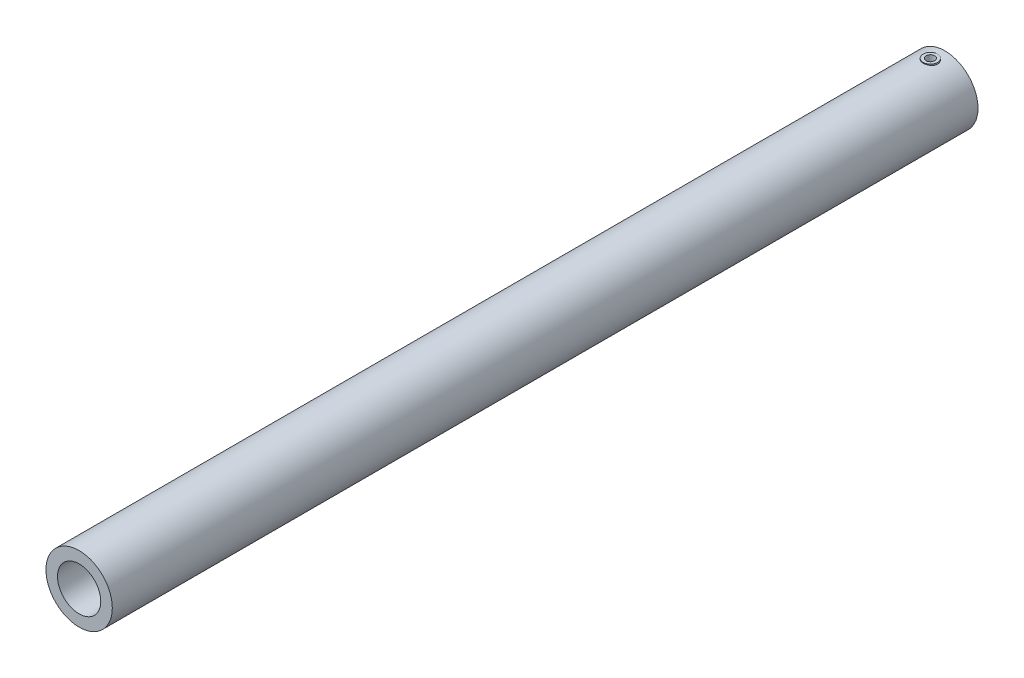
ISO-10303-21;
HEADER;
FILE_DESCRIPTION(('STEP AP214'),'2;1');
FILE_NAME('part.step','',(''),(''),'','','');
FILE_SCHEMA(('AUTOMOTIVE_DESIGN { 1 0 10303 214 1 1 1 1 }'));
ENDSEC;
DATA;
#1=APPLICATION_CONTEXT('core data for automotive mechanical design processes');
#2=APPLICATION_PROTOCOL_DEFINITION('international standard','automotive_design',2000,#1);
#3=PRODUCT_CONTEXT('',#1,'mechanical');
#4=PRODUCT('Part','Part','',(#3));
#5=PRODUCT_RELATED_PRODUCT_CATEGORY('part','',(#4));
#6=PRODUCT_DEFINITION_FORMATION('','',#4);
#7=PRODUCT_DEFINITION_CONTEXT('part definition',#1,'design');
#8=PRODUCT_DEFINITION('design','',#6,#7);
#9=PRODUCT_DEFINITION_SHAPE('','',#8);
#10=(LENGTH_UNIT() NAMED_UNIT(*) SI_UNIT(.MILLI.,.METRE.));
#11=(NAMED_UNIT(*) PLANE_ANGLE_UNIT() SI_UNIT($,.RADIAN.));
#12=(NAMED_UNIT(*) SI_UNIT($,.STERADIAN.) SOLID_ANGLE_UNIT());
#13=UNCERTAINTY_MEASURE_WITH_UNIT(LENGTH_MEASURE(1.E-05),#10,'distance_accuracy_value','');
#14=(GEOMETRIC_REPRESENTATION_CONTEXT(3) GLOBAL_UNCERTAINTY_ASSIGNED_CONTEXT((#13)) GLOBAL_UNIT_ASSIGNED_CONTEXT((#10,
#11,#12)) REPRESENTATION_CONTEXT('',''));
#15=CARTESIAN_POINT('',(0.,0.,0.));
#16=DIRECTION('',(0.,0.,1.));
#17=DIRECTION('',(1.,0.,0.));
#18=AXIS2_PLACEMENT_3D('',#15,#16,#17);
#19=CARTESIAN_POINT('',(0.,0.,600.));
#20=DIRECTION('',(0.,0.,-1.));
#21=DIRECTION('',(-1.,0.,0.));
#22=AXIS2_PLACEMENT_3D('',#19,#20,#21);
#23=CYLINDRICAL_SURFACE('',#22,23.);
#24=CARTESIAN_POINT('',(0.,0.,0.));
#25=DIRECTION('',(0.,0.,1.));
#26=DIRECTION('',(1.,0.,0.));
#27=AXIS2_PLACEMENT_3D('',#24,#25,#26);
#28=CIRCLE('',#27,23.);
#29=CARTESIAN_POINT('',(23.,0.,0.));
#30=VERTEX_POINT('',#29);
#31=EDGE_CURVE('E43',#30,#30,#28,.T.);
#32=ORIENTED_EDGE('',*,*,#31,.T.);
#33=EDGE_LOOP('',(#32));
#34=FACE_BOUND('',#33,.T.);
#35=CARTESIAN_POINT('',(0.,0.,600.));
#36=DIRECTION('',(0.,0.,1.));
#37=DIRECTION('',(1.,0.,0.));
#38=AXIS2_PLACEMENT_3D('',#35,#36,#37);
#39=CIRCLE('',#38,23.);
#40=CARTESIAN_POINT('',(23.,0.,600.));
#41=VERTEX_POINT('',#40);
#42=EDGE_CURVE('E39',#41,#41,#39,.T.);
#43=ORIENTED_EDGE('',*,*,#42,.F.);
#44=EDGE_LOOP('',(#43));
#45=FACE_BOUND('',#44,.T.);
#46=CARTESIAN_POINT('',(0.,23.,15.));
#47=CARTESIAN_POINT('',(0.277355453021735,22.9999948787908,14.9999904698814));
#48=CARTESIAN_POINT('',(0.554826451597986,22.9949320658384,14.9768442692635));
#49=CARTESIAN_POINT('',(1.10188982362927,22.9752244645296,14.8849654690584));
#50=CARTESIAN_POINT('',(1.37147637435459,22.9605727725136,14.8162000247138));
#51=CARTESIAN_POINT('',(1.89478531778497,22.9233191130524,14.6353360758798));
#52=CARTESIAN_POINT('',(2.14852386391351,22.9007254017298,14.523282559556));
#53=CARTESIAN_POINT('',(2.63358953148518,22.8500275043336,14.2591653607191));
#54=CARTESIAN_POINT('',(2.86491728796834,22.8219234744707,14.1071028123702));
#55=CARTESIAN_POINT('',(3.30227374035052,22.7627863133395,13.7647311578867));
#56=CARTESIAN_POINT('',(3.50789604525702,22.7317172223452,13.5739090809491));
#57=CARTESIAN_POINT('',(3.8844813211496,22.6704056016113,13.1605364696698));
#58=CARTESIAN_POINT('',(4.05544123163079,22.6401631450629,12.9379831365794));
#59=CARTESIAN_POINT('',(4.35963714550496,22.5835746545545,12.4644667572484));
#60=CARTESIAN_POINT('',(4.49244139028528,22.557274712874,12.2132203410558));
#61=CARTESIAN_POINT('',(4.7137868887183,22.5120647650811,11.6913104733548));
#62=CARTESIAN_POINT('',(4.8023333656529,22.4931538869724,11.4206493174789));
#63=CARTESIAN_POINT('',(4.93130849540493,22.4652292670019,10.8719987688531));
#64=CARTESIAN_POINT('',(4.97245619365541,22.4560677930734,10.5941860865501));
#65=CARTESIAN_POINT('',(5.00770133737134,22.4482355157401,10.0354611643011));
#66=CARTESIAN_POINT('',(5.00180449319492,22.4495634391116,9.75454930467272));
#67=CARTESIAN_POINT('',(4.94370678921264,22.462426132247,9.20293933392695));
#68=CARTESIAN_POINT('',(4.89234041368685,22.473776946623,8.93214839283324));
#69=CARTESIAN_POINT('',(4.74608346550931,22.5051157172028,8.40312176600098));
#70=CARTESIAN_POINT('',(4.65119047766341,22.5251041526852,8.14488677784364));
#71=CARTESIAN_POINT('',(4.41980547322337,22.5716477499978,7.64595211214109));
#72=CARTESIAN_POINT('',(4.28299185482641,22.5982533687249,7.40540648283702));
#73=CARTESIAN_POINT('',(3.97187541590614,22.6550024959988,6.95037821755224));
#74=CARTESIAN_POINT('',(3.79756754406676,22.685146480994,6.73589909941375));
#75=CARTESIAN_POINT('',(3.41198948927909,22.7463657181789,6.33428694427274));
#76=CARTESIAN_POINT('',(3.20000952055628,22.7774471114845,6.14783562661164));
#77=CARTESIAN_POINT('',(2.74743924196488,22.8364526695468,5.81301931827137));
#78=CARTESIAN_POINT('',(2.50684842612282,22.8643767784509,5.66465500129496));
#79=CARTESIAN_POINT('',(2.00305938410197,22.9140103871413,5.41005890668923));
#80=CARTESIAN_POINT('',(1.73981507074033,22.9357068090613,5.30391561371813));
#81=CARTESIAN_POINT('',(1.19865085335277,22.9703430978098,5.13755845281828));
#82=CARTESIAN_POINT('',(0.920733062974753,22.9832842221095,5.07733798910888));
#83=CARTESIAN_POINT('',(0.363959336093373,22.998773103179,5.0055255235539));
#84=CARTESIAN_POINT('',(0.0852289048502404,23.0015198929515,4.99300216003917));
#85=CARTESIAN_POINT('',(-0.470341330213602,22.9968679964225,5.01441617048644));
#86=CARTESIAN_POINT('',(-0.747181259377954,22.9894699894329,5.04835043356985));
#87=CARTESIAN_POINT('',(-1.28803214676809,22.965485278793,5.16094402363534));
#88=CARTESIAN_POINT('',(-1.55214947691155,22.9489988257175,5.23911563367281));
#89=CARTESIAN_POINT('',(-2.06352339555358,22.908682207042,5.43742418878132));
#90=CARTESIAN_POINT('',(-2.31077855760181,22.8848514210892,5.55756467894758));
#91=CARTESIAN_POINT('',(-2.78526633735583,22.8319982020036,5.83834667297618));
#92=CARTESIAN_POINT('',(-3.01216677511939,22.8029071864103,5.99953632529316));
#93=CARTESIAN_POINT('',(-3.43603237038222,22.7429019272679,6.35711834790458));
#94=CARTESIAN_POINT('',(-3.63299368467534,22.7119874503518,6.55351523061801));
#95=CARTESIAN_POINT('',(-3.99506577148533,22.6511332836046,6.98020810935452));
#96=CARTESIAN_POINT('',(-4.15953201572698,22.6212215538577,7.21105574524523));
#97=CARTESIAN_POINT('',(-4.44736358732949,22.5664022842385,7.69764303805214));
#98=CARTESIAN_POINT('',(-4.57073068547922,22.5414945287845,7.95338162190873));
#99=CARTESIAN_POINT('',(-4.7720341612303,22.4997392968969,8.48112433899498));
#100=CARTESIAN_POINT('',(-4.8502247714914,22.4828468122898,8.75302776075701));
#101=CARTESIAN_POINT('',(-4.95970263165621,22.4589524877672,9.30652786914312));
#102=CARTESIAN_POINT('',(-4.99099727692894,22.4519490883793,9.58812302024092));
#103=CARTESIAN_POINT('',(-5.00548311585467,22.448723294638,10.1465166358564));
#104=CARTESIAN_POINT('',(-4.98969596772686,22.4522719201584,10.4232877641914));
#105=CARTESIAN_POINT('',(-4.91274819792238,22.4692329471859,10.9701251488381));
#106=CARTESIAN_POINT('',(-4.85158809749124,22.482645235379,11.2401914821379));
#107=CARTESIAN_POINT('',(-4.68612139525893,22.5177114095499,11.7651534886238));
#108=CARTESIAN_POINT('',(-4.5819617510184,22.5393372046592,12.0200974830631));
#109=CARTESIAN_POINT('',(-4.33357956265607,22.5884050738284,12.5090440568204));
#110=CARTESIAN_POINT('',(-4.1893529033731,22.6158477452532,12.7430444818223));
#111=CARTESIAN_POINT('',(-3.86153463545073,22.6741425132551,13.1885016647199));
#112=CARTESIAN_POINT('',(-3.67721419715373,22.7050517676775,13.3994146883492));
#113=CARTESIAN_POINT('',(-3.27591964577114,22.7664110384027,13.7876521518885));
#114=CARTESIAN_POINT('',(-3.05893799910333,22.796860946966,13.9649688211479));
#115=CARTESIAN_POINT('',(-2.59513904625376,22.8543320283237,14.283147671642));
#116=CARTESIAN_POINT('',(-2.34797586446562,22.8813044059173,14.4235149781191));
#117=CARTESIAN_POINT('',(-1.83303166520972,22.9282925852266,14.6604916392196));
#118=CARTESIAN_POINT('',(-1.56526825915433,22.948314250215,14.7571378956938));
#119=CARTESIAN_POINT('',(-1.08101000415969,22.9755491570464,14.8865936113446));
#120=CARTESIAN_POINT('',(-0.867145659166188,22.9846616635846,14.9290402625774));
#121=CARTESIAN_POINT('',(-0.435544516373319,22.9968889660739,14.9857465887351));
#122=CARTESIAN_POINT('',(-0.217807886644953,23.0000040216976,15.0000074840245));
#123=CARTESIAN_POINT('',(0.,23.,15.));
#124=B_SPLINE_CURVE_WITH_KNOTS('',3,(#46,#47,#48,#49,#50,#51,#52,#53,#54,#55,#56,#57,#58,#59,
#60,#61,#62,#63,#64,#65,#66,#67,#68,#69,#70,#71,#72,#73,#74,#75,#76,#77,#78,#79,#80,#81,#82,#83,
#84,#85,#86,#87,#88,#89,#90,#91,#92,#93,#94,#95,#96,#97,#98,#99,#100,#101,#102,#103,#104,#105,
#106,#107,#108,#109,#110,#111,#112,#113,#114,#115,#116,#117,#118,#119,#120,#121,#122,#123),
.UNSPECIFIED.,.T.,.F.,(4,2,2,2,2,2,2,2,2,2,2,2,2,2,2,2,2,2,2,2,2,2,2,2,2,2,2,2,2,2,2,2,2,2,2,2,
2,2,4),(0.,0.831269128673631,1.66313740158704,2.49414345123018,3.32512594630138,4.1679214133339,
5.01079126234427,5.8628536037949,6.71481536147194,7.55367510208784,8.39243302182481,
9.21610950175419,10.0398316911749,10.8700385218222,11.7003572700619,12.5484059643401,
13.3964696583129,14.2463014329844,15.0960111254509,15.9290411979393,16.7620154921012,
17.5859803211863,18.4100147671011,19.2456896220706,20.0814716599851,20.9324565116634,
21.7834046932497,22.6295162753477,23.4754944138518,24.3032496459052,25.1309953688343,
25.9559352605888,26.7809599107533,27.6224659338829,28.4641663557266,29.3166242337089,
30.1683612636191,30.8211871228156,31.4739847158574),.UNSPECIFIED.);
#125=CARTESIAN_POINT('',(0.,23.,15.));
#126=VERTEX_POINT('',#125);
#127=EDGE_CURVE('E55',#126,#126,#124,.T.);
#128=ORIENTED_EDGE('',*,*,#127,.F.);
#129=EDGE_LOOP('',(#128));
#130=FACE_BOUND('',#129,.T.);
#131=CARTESIAN_POINT('',(0.,-23.,5.));
#132=CARTESIAN_POINT('',(0.277355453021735,-22.9999948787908,5.00000953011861));
#133=CARTESIAN_POINT('',(0.554826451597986,-22.9949320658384,5.02315573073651));
#134=CARTESIAN_POINT('',(1.10188982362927,-22.9752244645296,5.11503453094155));
#135=CARTESIAN_POINT('',(1.37147637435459,-22.9605727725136,5.18379997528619));
#136=CARTESIAN_POINT('',(1.89478531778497,-22.9233191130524,5.36466392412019));
#137=CARTESIAN_POINT('',(2.14852386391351,-22.9007254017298,5.47671744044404));
#138=CARTESIAN_POINT('',(2.63358953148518,-22.8500275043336,5.74083463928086));
#139=CARTESIAN_POINT('',(2.86491728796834,-22.8219234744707,5.89289718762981));
#140=CARTESIAN_POINT('',(3.30227374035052,-22.7627863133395,6.23526884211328));
#141=CARTESIAN_POINT('',(3.50789604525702,-22.7317172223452,6.42609091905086));
#142=CARTESIAN_POINT('',(3.8844813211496,-22.6704056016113,6.83946353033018));
#143=CARTESIAN_POINT('',(4.05544123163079,-22.6401631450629,7.06201686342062));
#144=CARTESIAN_POINT('',(4.35963714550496,-22.5835746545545,7.53553324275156));
#145=CARTESIAN_POINT('',(4.49244139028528,-22.557274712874,7.78677965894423));
#146=CARTESIAN_POINT('',(4.7137868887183,-22.5120647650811,8.30868952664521));
#147=CARTESIAN_POINT('',(4.80233336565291,-22.4931538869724,8.57935068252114));
#148=CARTESIAN_POINT('',(4.93130849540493,-22.4652292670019,9.12800123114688));
#149=CARTESIAN_POINT('',(4.97245619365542,-22.4560677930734,9.4058139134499));
#150=CARTESIAN_POINT('',(5.00770133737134,-22.4482355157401,9.96453883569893));
#151=CARTESIAN_POINT('',(5.00180449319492,-22.4495634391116,10.2454506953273));
#152=CARTESIAN_POINT('',(4.94370678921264,-22.462426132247,10.797060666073));
#153=CARTESIAN_POINT('',(4.89234041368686,-22.473776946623,11.0678516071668));
#154=CARTESIAN_POINT('',(4.74608346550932,-22.5051157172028,11.596878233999));
#155=CARTESIAN_POINT('',(4.65119047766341,-22.5251041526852,11.8551132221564));
#156=CARTESIAN_POINT('',(4.41980547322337,-22.5716477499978,12.3540478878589));
#157=CARTESIAN_POINT('',(4.28299185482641,-22.5982533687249,12.594593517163));
#158=CARTESIAN_POINT('',(3.97187541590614,-22.6550024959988,13.0496217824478));
#159=CARTESIAN_POINT('',(3.79756754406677,-22.685146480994,13.2641009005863));
#160=CARTESIAN_POINT('',(3.41198948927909,-22.7463657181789,13.6657130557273));
#161=CARTESIAN_POINT('',(3.20000952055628,-22.7774471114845,13.8521643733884));
#162=CARTESIAN_POINT('',(2.74743924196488,-22.8364526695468,14.1869806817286));
#163=CARTESIAN_POINT('',(2.50684842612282,-22.8643767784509,14.335344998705));
#164=CARTESIAN_POINT('',(2.00305938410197,-22.9140103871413,14.5899410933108));
#165=CARTESIAN_POINT('',(1.73981507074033,-22.9357068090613,14.6960843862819));
#166=CARTESIAN_POINT('',(1.19865085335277,-22.9703430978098,14.8624415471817));
#167=CARTESIAN_POINT('',(0.920733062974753,-22.9832842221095,14.9226620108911));
#168=CARTESIAN_POINT('',(0.363959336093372,-22.998773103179,14.9944744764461));
#169=CARTESIAN_POINT('',(0.0852289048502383,-23.0015198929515,15.0069978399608));
#170=CARTESIAN_POINT('',(-0.470341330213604,-22.9968679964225,14.9855838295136));
#171=CARTESIAN_POINT('',(-0.747181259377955,-22.9894699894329,14.9516495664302));
#172=CARTESIAN_POINT('',(-1.28803214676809,-22.965485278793,14.8390559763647));
#173=CARTESIAN_POINT('',(-1.55214947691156,-22.9489988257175,14.7608843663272));
#174=CARTESIAN_POINT('',(-2.06352339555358,-22.908682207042,14.5625758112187));
#175=CARTESIAN_POINT('',(-2.31077855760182,-22.8848514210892,14.4424353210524));
#176=CARTESIAN_POINT('',(-2.78526633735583,-22.8319982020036,14.1616533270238));
#177=CARTESIAN_POINT('',(-3.01216677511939,-22.8029071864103,14.0004636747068));
#178=CARTESIAN_POINT('',(-3.43603237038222,-22.7429019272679,13.6428816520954));
#179=CARTESIAN_POINT('',(-3.63299368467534,-22.7119874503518,13.446484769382));
#180=CARTESIAN_POINT('',(-3.99506577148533,-22.6511332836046,13.0197918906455));
#181=CARTESIAN_POINT('',(-4.15953201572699,-22.6212215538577,12.7889442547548));
#182=CARTESIAN_POINT('',(-4.44736358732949,-22.5664022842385,12.3023569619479));
#183=CARTESIAN_POINT('',(-4.57073068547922,-22.5414945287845,12.0466183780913));
#184=CARTESIAN_POINT('',(-4.77203416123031,-22.4997392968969,11.518875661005));
#185=CARTESIAN_POINT('',(-4.8502247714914,-22.4828468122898,11.246972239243));
#186=CARTESIAN_POINT('',(-4.95970263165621,-22.4589524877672,10.6934721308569));
#187=CARTESIAN_POINT('',(-4.99099727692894,-22.4519490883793,10.4118769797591));
#188=CARTESIAN_POINT('',(-5.00548311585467,-22.448723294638,9.85348336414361));
#189=CARTESIAN_POINT('',(-4.98969596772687,-22.4522719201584,9.57671223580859));
#190=CARTESIAN_POINT('',(-4.91274819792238,-22.4692329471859,9.02987485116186));
#191=CARTESIAN_POINT('',(-4.85158809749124,-22.482645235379,8.75980851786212));
#192=CARTESIAN_POINT('',(-4.68612139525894,-22.5177114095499,8.23484651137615));
#193=CARTESIAN_POINT('',(-4.5819617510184,-22.5393372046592,7.9799025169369));
#194=CARTESIAN_POINT('',(-4.33357956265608,-22.5884050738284,7.49095594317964));
#195=CARTESIAN_POINT('',(-4.1893529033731,-22.6158477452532,7.25695551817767));
#196=CARTESIAN_POINT('',(-3.86153463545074,-22.6741425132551,6.81149833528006));
#197=CARTESIAN_POINT('',(-3.67721419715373,-22.7050517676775,6.60058531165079));
#198=CARTESIAN_POINT('',(-3.27591964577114,-22.7664110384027,6.21234784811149));
#199=CARTESIAN_POINT('',(-3.05893799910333,-22.796860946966,6.03503117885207));
#200=CARTESIAN_POINT('',(-2.59513904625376,-22.8543320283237,5.71685232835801));
#201=CARTESIAN_POINT('',(-2.34797586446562,-22.8813044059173,5.57648502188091));
#202=CARTESIAN_POINT('',(-1.83303166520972,-22.9282925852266,5.33950836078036));
#203=CARTESIAN_POINT('',(-1.56526825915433,-22.948314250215,5.24286210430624));
#204=CARTESIAN_POINT('',(-1.0810100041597,-22.9755491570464,5.11340638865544));
#205=CARTESIAN_POINT('',(-0.867145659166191,-22.9846616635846,5.07095973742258));
#206=CARTESIAN_POINT('',(-0.435544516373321,-22.9968889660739,5.01425341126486));
#207=CARTESIAN_POINT('',(-0.217807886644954,-23.0000040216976,4.99999251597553));
#208=CARTESIAN_POINT('',(0.,-23.,5.));
#209=B_SPLINE_CURVE_WITH_KNOTS('',3,(#131,#132,#133,#134,#135,#136,#137,#138,#139,#140,#141,
#142,#143,#144,#145,#146,#147,#148,#149,#150,#151,#152,#153,#154,#155,#156,#157,#158,#159,#160,
#161,#162,#163,#164,#165,#166,#167,#168,#169,#170,#171,#172,#173,#174,#175,#176,#177,#178,#179,
#180,#181,#182,#183,#184,#185,#186,#187,#188,#189,#190,#191,#192,#193,#194,#195,#196,#197,#198,
#199,#200,#201,#202,#203,#204,#205,#206,#207,#208),.UNSPECIFIED.,.T.,.F.,(4,2,2,2,2,2,2,2,2,2,2,
2,2,2,2,2,2,2,2,2,2,2,2,2,2,2,2,2,2,2,2,2,2,2,2,2,2,2,4),(0.,0.83126912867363,1.66313740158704,
2.49414345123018,3.32512594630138,4.1679214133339,5.01079126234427,5.8628536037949,
6.71481536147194,7.55367510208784,8.39243302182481,9.21610950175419,10.0398316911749,
10.8700385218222,11.7003572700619,12.5484059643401,13.3964696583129,14.2463014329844,
15.0960111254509,15.9290411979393,16.7620154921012,17.5859803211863,18.4100147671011,
19.2456896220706,20.0814716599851,20.9324565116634,21.7834046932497,22.6295162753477,
23.4754944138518,24.3032496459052,25.1309953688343,25.9559352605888,26.7809599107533,
27.6224659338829,28.4641663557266,29.3166242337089,30.1683612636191,30.8211871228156,
31.4739847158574),.UNSPECIFIED.);
#210=CARTESIAN_POINT('',(0.,-23.,5.));
#211=VERTEX_POINT('',#210);
#212=EDGE_CURVE('E10',#211,#211,#209,.T.);
#213=ORIENTED_EDGE('',*,*,#212,.F.);
#214=EDGE_LOOP('',(#213));
#215=FACE_BOUND('',#214,.T.);
#216=ADVANCED_FACE('F29',(#34,#45,#130,#215),#23,.T.);
#217=CARTESIAN_POINT('',(0.,0.,600.));
#218=DIRECTION('',(0.,0.,1.));
#219=DIRECTION('',(1.,0.,0.));
#220=AXIS2_PLACEMENT_3D('',#217,#218,#219);
#221=PLANE('',#220);
#222=CARTESIAN_POINT('',(0.,0.,600.));
#223=DIRECTION('',(0.,0.,1.));
#224=DIRECTION('',(1.,0.,0.));
#225=AXIS2_PLACEMENT_3D('',#222,#223,#224);
#226=CIRCLE('',#225,15.);
#227=CARTESIAN_POINT('',(15.,0.,600.));
#228=VERTEX_POINT('',#227);
#229=EDGE_CURVE('E52',#228,#228,#226,.T.);
#230=ORIENTED_EDGE('',*,*,#229,.F.);
#231=EDGE_LOOP('',(#230));
#232=FACE_BOUND('',#231,.T.);
#233=ORIENTED_EDGE('',*,*,#42,.T.);
#234=EDGE_LOOP('',(#233));
#235=FACE_BOUND('',#234,.T.);
#236=ADVANCED_FACE('F90',(#232,#235),#221,.T.);
#237=CARTESIAN_POINT('',(0.,0.,0.));
#238=DIRECTION('',(0.,0.,1.));
#239=DIRECTION('',(1.,0.,0.));
#240=AXIS2_PLACEMENT_3D('',#237,#238,#239);
#241=PLANE('',#240);
#242=ORIENTED_EDGE('',*,*,#31,.F.);
#243=EDGE_LOOP('',(#242));
#244=FACE_BOUND('',#243,.T.);
#245=ADVANCED_FACE('F95',(#244),#241,.F.);
#246=CARTESIAN_POINT('',(0.,0.,510.));
#247=DIRECTION('',(0.,0.,1.));
#248=DIRECTION('',(1.,0.,0.));
#249=AXIS2_PLACEMENT_3D('',#246,#247,#248);
#250=CYLINDRICAL_SURFACE('',#249,15.);
#251=CARTESIAN_POINT('',(0.,0.,510.));
#252=DIRECTION('',(0.,0.,1.));
#253=DIRECTION('',(1.,0.,0.));
#254=AXIS2_PLACEMENT_3D('',#251,#252,#253);
#255=CIRCLE('',#254,15.);
#256=CARTESIAN_POINT('',(15.,0.,510.));
#257=VERTEX_POINT('',#256);
#258=EDGE_CURVE('E47',#257,#257,#255,.T.);
#259=CARTESIAN_POINT('',(15.,0.,510.));
#260=CARTESIAN_POINT('',(15.,0.,510.9375));
#261=CARTESIAN_POINT('',(15.,0.,511.875));
#262=CARTESIAN_POINT('',(15.,0.,513.75));
#263=CARTESIAN_POINT('',(15.,0.,514.6875));
#264=CARTESIAN_POINT('',(15.,0.,516.5625));
#265=CARTESIAN_POINT('',(15.,0.,517.5));
#266=CARTESIAN_POINT('',(15.,0.,519.375));
#267=CARTESIAN_POINT('',(15.,0.,520.3125));
#268=CARTESIAN_POINT('',(15.,0.,522.1875));
#269=CARTESIAN_POINT('',(15.,0.,523.125));
#270=CARTESIAN_POINT('',(15.,0.,525.));
#271=CARTESIAN_POINT('',(15.,0.,525.9375));
#272=CARTESIAN_POINT('',(15.,0.,527.8125));
#273=CARTESIAN_POINT('',(15.,0.,528.75));
#274=CARTESIAN_POINT('',(15.,0.,530.625));
#275=CARTESIAN_POINT('',(15.,0.,531.5625));
#276=CARTESIAN_POINT('',(15.,0.,533.4375));
#277=CARTESIAN_POINT('',(15.,0.,534.375));
#278=CARTESIAN_POINT('',(15.,0.,536.25));
#279=CARTESIAN_POINT('',(15.,0.,537.1875));
#280=CARTESIAN_POINT('',(15.,0.,539.0625));
#281=CARTESIAN_POINT('',(15.,0.,540.));
#282=CARTESIAN_POINT('',(15.,0.,541.875));
#283=CARTESIAN_POINT('',(15.,0.,542.8125));
#284=CARTESIAN_POINT('',(15.,0.,544.6875));
#285=CARTESIAN_POINT('',(15.,0.,545.625));
#286=CARTESIAN_POINT('',(15.,0.,547.5));
#287=CARTESIAN_POINT('',(15.,0.,548.4375));
#288=CARTESIAN_POINT('',(15.,0.,550.3125));
#289=CARTESIAN_POINT('',(15.,0.,551.25));
#290=CARTESIAN_POINT('',(15.,0.,553.125));
#291=CARTESIAN_POINT('',(15.,0.,554.0625));
#292=CARTESIAN_POINT('',(15.,0.,555.9375));
#293=CARTESIAN_POINT('',(15.,0.,556.875));
#294=CARTESIAN_POINT('',(15.,0.,558.75));
#295=CARTESIAN_POINT('',(15.,0.,559.6875));
#296=CARTESIAN_POINT('',(15.,0.,561.5625));
#297=CARTESIAN_POINT('',(15.,0.,562.5));
#298=CARTESIAN_POINT('',(15.,0.,564.375));
#299=CARTESIAN_POINT('',(15.,0.,565.3125));
#300=CARTESIAN_POINT('',(15.,0.,567.1875));
#301=CARTESIAN_POINT('',(15.,0.,568.125));
#302=CARTESIAN_POINT('',(15.,0.,570.));
#303=CARTESIAN_POINT('',(15.,0.,570.9375));
#304=CARTESIAN_POINT('',(15.,0.,572.8125));
#305=CARTESIAN_POINT('',(15.,0.,573.75));
#306=CARTESIAN_POINT('',(15.,0.,575.625));
#307=CARTESIAN_POINT('',(15.,0.,576.5625));
#308=CARTESIAN_POINT('',(15.,0.,578.4375));
#309=CARTESIAN_POINT('',(15.,0.,579.375));
#310=CARTESIAN_POINT('',(15.,0.,581.25));
#311=CARTESIAN_POINT('',(15.,0.,582.1875));
#312=CARTESIAN_POINT('',(15.,0.,584.0625));
#313=CARTESIAN_POINT('',(15.,0.,585.));
#314=CARTESIAN_POINT('',(15.,0.,586.875));
#315=CARTESIAN_POINT('',(15.,0.,587.8125));
#316=CARTESIAN_POINT('',(15.,0.,589.6875));
#317=CARTESIAN_POINT('',(15.,0.,590.625));
#318=CARTESIAN_POINT('',(15.,0.,592.5));
#319=CARTESIAN_POINT('',(15.,0.,593.4375));
#320=CARTESIAN_POINT('',(15.,0.,595.3125));
#321=CARTESIAN_POINT('',(15.,0.,596.25));
#322=CARTESIAN_POINT('',(15.,0.,598.125));
#323=CARTESIAN_POINT('',(15.,0.,599.0625));
#324=CARTESIAN_POINT('',(15.,0.,600.));
#325=B_SPLINE_CURVE_WITH_KNOTS('',3,(#259,#260,#261,#262,#263,#264,#265,#266,#267,#268,#269,
#270,#271,#272,#273,#274,#275,#276,#277,#278,#279,#280,#281,#282,#283,#284,#285,#286,#287,#288,
#289,#290,#291,#292,#293,#294,#295,#296,#297,#298,#299,#300,#301,#302,#303,#304,#305,#306,#307,
#308,#309,#310,#311,#312,#313,#314,#315,#316,#317,#318,#319,#320,#321,#322,#323,#324),
.UNSPECIFIED.,.F.,.F.,(4,2,2,2,2,2,2,2,2,2,2,2,2,2,2,2,2,2,2,2,2,2,2,2,2,2,2,2,2,2,2,2,4),(0.,
2.8125,5.62499999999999,8.43749999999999,11.25,14.0625,16.875,19.6875,22.5,25.3125,28.125,
30.9375,33.7499999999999,36.5624999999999,39.3749999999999,42.1874999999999,44.9999999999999,
47.8124999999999,50.6249999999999,53.4374999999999,56.2499999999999,59.0624999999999,
61.8749999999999,64.6874999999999,67.4999999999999,70.3124999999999,73.1249999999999,
75.9374999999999,78.7499999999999,81.5625,84.3749999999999,87.1875,90.),.UNSPECIFIED.);
#326=EDGE_CURVE('BSEAM82',#257,#228,#325,.T.);
#327=ORIENTED_EDGE('',*,*,#258,.F.);
#328=ORIENTED_EDGE('',*,*,#229,.T.);
#329=ORIENTED_EDGE('',*,*,#326,.T.);
#330=ORIENTED_EDGE('',*,*,#326,.F.);
#331=EDGE_LOOP('',(#327,#329,#328,#330));
#332=FACE_BOUND('',#331,.T.);
#333=ADVANCED_FACE('F82',(#332),#250,.F.);
#334=CARTESIAN_POINT('',(0.,0.,510.));
#335=DIRECTION('',(0.,0.,1.));
#336=DIRECTION('',(1.,0.,0.));
#337=AXIS2_PLACEMENT_3D('',#334,#335,#336);
#338=PLANE('',#337);
#339=ORIENTED_EDGE('',*,*,#258,.T.);
#340=EDGE_LOOP('',(#339));
#341=FACE_BOUND('',#340,.T.);
#342=ADVANCED_FACE('F74',(#341),#338,.T.);
#343=CARTESIAN_POINT('',(0.,23.5,10.));
#344=DIRECTION('',(0.,1.,0.));
#345=DIRECTION('',(0.,0.,1.));
#346=AXIS2_PLACEMENT_3D('',#343,#344,#345);
#347=PLANE('',#346);
#348=CARTESIAN_POINT('',(0.,23.5,10.));
#349=DIRECTION('',(0.,1.,0.));
#350=DIRECTION('',(0.,0.,1.));
#351=AXIS2_PLACEMENT_3D('',#348,#349,#350);
#352=CIRCLE('',#351,3.);
#353=CARTESIAN_POINT('',(0.,23.5,13.));
#354=VERTEX_POINT('',#353);
#355=EDGE_CURVE('E196',#354,#354,#352,.T.);
#356=ORIENTED_EDGE('',*,*,#355,.F.);
#357=EDGE_LOOP('',(#356));
#358=FACE_BOUND('',#357,.T.);
#359=CARTESIAN_POINT('',(0.,23.5,10.));
#360=DIRECTION('',(0.,1.,0.));
#361=DIRECTION('',(0.,0.,1.));
#362=AXIS2_PLACEMENT_3D('',#359,#360,#361);
#363=CIRCLE('',#362,5.);
#364=CARTESIAN_POINT('',(0.,23.5,15.));
#365=VERTEX_POINT('',#364);
#366=EDGE_CURVE('E62',#365,#365,#363,.T.);
#367=ORIENTED_EDGE('',*,*,#366,.T.);
#368=EDGE_LOOP('',(#367));
#369=FACE_BOUND('',#368,.T.);
#370=ADVANCED_FACE('F72',(#358,#369),#347,.T.);
#371=CARTESIAN_POINT('',(0.,-500000.,10.));
#372=DIRECTION('',(0.,1.,0.));
#373=DIRECTION('',(0.,0.,1.));
#374=AXIS2_PLACEMENT_3D('',#371,#372,#373);
#375=CYLINDRICAL_SURFACE('',#374,5.);
#376=ORIENTED_EDGE('',*,*,#366,.F.);
#377=EDGE_LOOP('',(#376));
#378=FACE_BOUND('',#377,.T.);
#379=ORIENTED_EDGE('',*,*,#127,.T.);
#380=EDGE_LOOP('',(#379));
#381=FACE_BOUND('',#380,.T.);
#382=ADVANCED_FACE('F64',(#378,#381),#375,.T.);
#383=CARTESIAN_POINT('',(0.,-23.5,10.));
#384=DIRECTION('',(0.,1.,0.));
#385=DIRECTION('',(0.,0.,1.));
#386=AXIS2_PLACEMENT_3D('',#383,#384,#385);
#387=PLANE('',#386);
#388=CARTESIAN_POINT('',(0.,-23.5,10.));
#389=DIRECTION('',(0.,-1.,0.));
#390=DIRECTION('',(0.,0.,-1.));
#391=AXIS2_PLACEMENT_3D('',#388,#389,#390);
#392=CIRCLE('',#391,3.);
#393=CARTESIAN_POINT('',(0.,-23.5,7.));
#394=VERTEX_POINT('',#393);
#395=EDGE_CURVE('E195',#394,#394,#392,.T.);
#396=ORIENTED_EDGE('',*,*,#395,.F.);
#397=EDGE_LOOP('',(#396));
#398=FACE_BOUND('',#397,.T.);
#399=CARTESIAN_POINT('',(0.,-23.5,10.));
#400=DIRECTION('',(0.,1.,0.));
#401=DIRECTION('',(0.,0.,1.));
#402=AXIS2_PLACEMENT_3D('',#399,#400,#401);
#403=CIRCLE('',#402,5.);
#404=CARTESIAN_POINT('',(0.,-23.5,15.));
#405=VERTEX_POINT('',#404);
#406=EDGE_CURVE('E205',#405,#405,#403,.T.);
#407=ORIENTED_EDGE('',*,*,#406,.F.);
#408=EDGE_LOOP('',(#407));
#409=FACE_BOUND('',#408,.T.);
#410=ADVANCED_FACE('F80',(#398,#409),#387,.F.);
#411=CARTESIAN_POINT('',(0.,500000.,10.));
#412=DIRECTION('',(0.,-1.,0.));
#413=DIRECTION('',(0.,0.,-1.));
#414=AXIS2_PLACEMENT_3D('',#411,#412,#413);
#415=CYLINDRICAL_SURFACE('',#414,5.);
#416=ORIENTED_EDGE('',*,*,#406,.T.);
#417=EDGE_LOOP('',(#416));
#418=FACE_BOUND('',#417,.T.);
#419=ORIENTED_EDGE('',*,*,#212,.T.);
#420=EDGE_LOOP('',(#419));
#421=FACE_BOUND('',#420,.T.);
#422=ADVANCED_FACE('F69',(#418,#421),#415,.T.);
#423=CARTESIAN_POINT('',(0.,-13.5,10.));
#424=DIRECTION('',(0.,-1.,0.));
#425=DIRECTION('',(0.,0.,-1.));
#426=AXIS2_PLACEMENT_3D('',#423,#424,#425);
#427=CYLINDRICAL_SURFACE('',#426,3.);
#428=CARTESIAN_POINT('',(0.,-13.5,10.));
#429=DIRECTION('',(0.,-1.,0.));
#430=DIRECTION('',(0.,0.,-1.));
#431=AXIS2_PLACEMENT_3D('',#428,#429,#430);
#432=CIRCLE('',#431,3.);
#433=CARTESIAN_POINT('',(0.,-13.5,7.));
#434=VERTEX_POINT('',#433);
#435=EDGE_CURVE('E199',#434,#434,#432,.T.);
#436=ORIENTED_EDGE('',*,*,#435,.F.);
#437=EDGE_LOOP('',(#436));
#438=FACE_BOUND('',#437,.T.);
#439=ORIENTED_EDGE('',*,*,#395,.T.);
#440=EDGE_LOOP('',(#439));
#441=FACE_BOUND('',#440,.T.);
#442=ADVANCED_FACE('F87',(#438,#441),#427,.F.);
#443=CARTESIAN_POINT('',(0.,-13.5,10.));
#444=DIRECTION('',(0.,-1.,0.));
#445=DIRECTION('',(0.,0.,-1.));
#446=AXIS2_PLACEMENT_3D('',#443,#444,#445);
#447=PLANE('',#446);
#448=ORIENTED_EDGE('',*,*,#435,.T.);
#449=EDGE_LOOP('',(#448));
#450=FACE_BOUND('',#449,.T.);
#451=ADVANCED_FACE('F155',(#450),#447,.T.);
#452=CARTESIAN_POINT('',(0.,13.5,10.));
#453=DIRECTION('',(0.,1.,0.));
#454=DIRECTION('',(0.,0.,1.));
#455=AXIS2_PLACEMENT_3D('',#452,#453,#454);
#456=CYLINDRICAL_SURFACE('',#455,3.);
#457=CARTESIAN_POINT('',(0.,13.5,10.));
#458=DIRECTION('',(0.,1.,0.));
#459=DIRECTION('',(0.,0.,1.));
#460=AXIS2_PLACEMENT_3D('',#457,#458,#459);
#461=CIRCLE('',#460,3.);
#462=CARTESIAN_POINT('',(0.,13.5,13.));
#463=VERTEX_POINT('',#462);
#464=EDGE_CURVE('E194',#463,#463,#461,.T.);
#465=ORIENTED_EDGE('',*,*,#464,.F.);
#466=EDGE_LOOP('',(#465));
#467=FACE_BOUND('',#466,.T.);
#468=ORIENTED_EDGE('',*,*,#355,.T.);
#469=EDGE_LOOP('',(#468));
#470=FACE_BOUND('',#469,.T.);
#471=ADVANCED_FACE('F164',(#467,#470),#456,.F.);
#472=CARTESIAN_POINT('',(0.,13.5,10.));
#473=DIRECTION('',(0.,1.,0.));
#474=DIRECTION('',(0.,0.,1.));
#475=AXIS2_PLACEMENT_3D('',#472,#473,#474);
#476=PLANE('',#475);
#477=ORIENTED_EDGE('',*,*,#464,.T.);
#478=EDGE_LOOP('',(#477));
#479=FACE_BOUND('',#478,.T.);
#480=ADVANCED_FACE('F178',(#479),#476,.T.);
#481=CLOSED_SHELL('',(#216,#236,#245,#333,#342,#370,#382,#410,#422,#442,#451,#471,#480));
#482=MANIFOLD_SOLID_BREP('B2',#481);
#483=ADVANCED_BREP_SHAPE_REPRESENTATION('',(#18,#482),#14);
#484=SHAPE_DEFINITION_REPRESENTATION(#9,#483);
ENDSEC;
END-ISO-10303-21;
